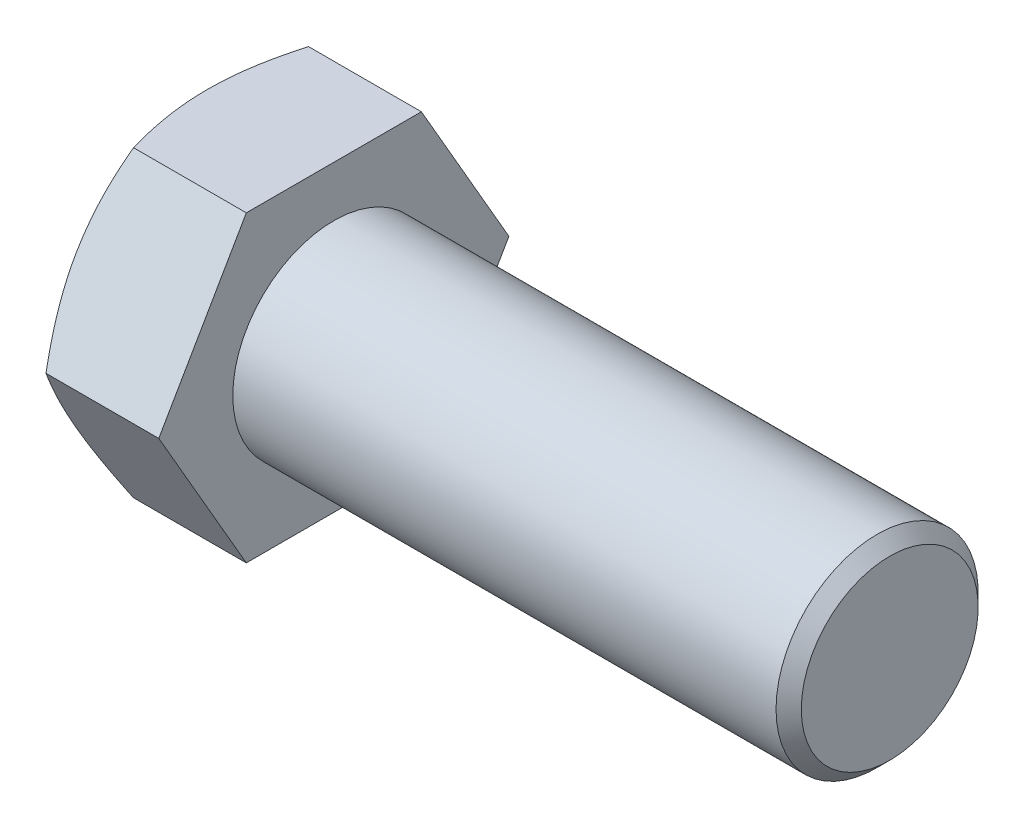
ISO-10303-21;
HEADER;
FILE_DESCRIPTION(('STEP AP214'),'2;1');
FILE_NAME('part.step','',(''),(''),'','','');
FILE_SCHEMA(('AUTOMOTIVE_DESIGN { 1 0 10303 214 1 1 1 1 }'));
ENDSEC;
DATA;
#1=APPLICATION_CONTEXT('core data for automotive mechanical design processes');
#2=APPLICATION_PROTOCOL_DEFINITION('international standard','automotive_design',2000,#1);
#3=PRODUCT_CONTEXT('',#1,'mechanical');
#4=PRODUCT('Part','Part','',(#3));
#5=PRODUCT_RELATED_PRODUCT_CATEGORY('part','',(#4));
#6=PRODUCT_DEFINITION_FORMATION('','',#4);
#7=PRODUCT_DEFINITION_CONTEXT('part definition',#1,'design');
#8=PRODUCT_DEFINITION('design','',#6,#7);
#9=PRODUCT_DEFINITION_SHAPE('','',#8);
#10=(LENGTH_UNIT() NAMED_UNIT(*) SI_UNIT(.MILLI.,.METRE.));
#11=(NAMED_UNIT(*) PLANE_ANGLE_UNIT() SI_UNIT($,.RADIAN.));
#12=(NAMED_UNIT(*) SI_UNIT($,.STERADIAN.) SOLID_ANGLE_UNIT());
#13=UNCERTAINTY_MEASURE_WITH_UNIT(LENGTH_MEASURE(1.E-05),#10,'distance_accuracy_value','');
#14=(GEOMETRIC_REPRESENTATION_CONTEXT(3) GLOBAL_UNCERTAINTY_ASSIGNED_CONTEXT((#13)) GLOBAL_UNIT_ASSIGNED_CONTEXT((#10,
#11,#12)) REPRESENTATION_CONTEXT('',''));
#15=CARTESIAN_POINT('',(0.,0.,0.));
#16=DIRECTION('',(0.,0.,1.));
#17=DIRECTION('',(1.,0.,0.));
#18=AXIS2_PLACEMENT_3D('',#15,#16,#17);
#19=CARTESIAN_POINT('',(0.,8.00000000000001,0.));
#20=DIRECTION('',(-1.,0.,0.));
#21=DIRECTION('',(0.,0.,1.));
#22=AXIS2_PLACEMENT_3D('',#19,#20,#21);
#23=PLANE('',#22);
#24=CARTESIAN_POINT('',(0.,0.,0.));
#25=DIRECTION('',(-1.,0.,0.));
#26=DIRECTION('',(0.,0.,1.));
#27=AXIS2_PLACEMENT_3D('',#24,#25,#26);
#28=CIRCLE('',#27,8.);
#29=CARTESIAN_POINT('',(0.,0.,8.));
#30=VERTEX_POINT('',#29);
#31=EDGE_CURVE('E133',#30,#30,#28,.T.);
#32=ORIENTED_EDGE('',*,*,#31,.T.);
#33=EDGE_LOOP('',(#32));
#34=FACE_BOUND('',#33,.T.);
#35=DIRECTION('',(0.,0.866025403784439,0.500000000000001));
#36=VECTOR('',#35,1.);
#37=CARTESIAN_POINT('',(0.,0.,13.856406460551));
#38=LINE('',#37,#36);
#39=CARTESIAN_POINT('',(0.,-12.,6.9282032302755));
#40=VERTEX_POINT('',#39);
#41=CARTESIAN_POINT('',(0.,0.,13.856406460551));
#42=VERTEX_POINT('',#41);
#43=EDGE_CURVE('E127',#40,#42,#38,.T.);
#44=ORIENTED_EDGE('',*,*,#43,.F.);
#45=DIRECTION('',(0.,0.,1.));
#46=VECTOR('',#45,1.);
#47=CARTESIAN_POINT('',(0.,-12.,0.));
#48=LINE('',#47,#46);
#49=CARTESIAN_POINT('',(0.,-12.,-6.92820323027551));
#50=VERTEX_POINT('',#49);
#51=EDGE_CURVE('E125',#50,#40,#48,.T.);
#52=ORIENTED_EDGE('',*,*,#51,.F.);
#53=DIRECTION('',(0.,-0.866025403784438,0.499999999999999));
#54=VECTOR('',#53,1.);
#55=CARTESIAN_POINT('',(0.,0.,-13.856406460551));
#56=LINE('',#55,#54);
#57=CARTESIAN_POINT('',(0.,0.,-13.856406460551));
#58=VERTEX_POINT('',#57);
#59=EDGE_CURVE('E120',#58,#50,#56,.T.);
#60=ORIENTED_EDGE('',*,*,#59,.F.);
#61=DIRECTION('',(0.,-0.866025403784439,-0.500000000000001));
#62=VECTOR('',#61,1.);
#63=CARTESIAN_POINT('',(0.,12.,-6.92820323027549));
#64=LINE('',#63,#62);
#65=CARTESIAN_POINT('',(0.,12.,-6.92820323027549));
#66=VERTEX_POINT('',#65);
#67=EDGE_CURVE('E118',#66,#58,#64,.T.);
#68=ORIENTED_EDGE('',*,*,#67,.F.);
#69=DIRECTION('',(0.,0.,-1.));
#70=VECTOR('',#69,1.);
#71=CARTESIAN_POINT('',(0.,12.,0.));
#72=LINE('',#71,#70);
#73=CARTESIAN_POINT('',(0.,12.,6.92820323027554));
#74=VERTEX_POINT('',#73);
#75=EDGE_CURVE('E105',#74,#66,#72,.T.);
#76=ORIENTED_EDGE('',*,*,#75,.F.);
#77=DIRECTION('',(0.,0.866025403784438,-0.499999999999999));
#78=VECTOR('',#77,1.);
#79=CARTESIAN_POINT('',(0.,12.,6.92820323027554));
#80=LINE('',#79,#78);
#81=EDGE_CURVE('E98',#42,#74,#80,.T.);
#82=ORIENTED_EDGE('',*,*,#81,.F.);
#83=EDGE_LOOP('',(#44,#52,#60,#68,#76,#82));
#84=FACE_BOUND('',#83,.T.);
#85=ADVANCED_FACE('F26',(#34,#84),#23,.F.);
#86=CARTESIAN_POINT('',(-30.,0.,0.));
#87=DIRECTION('',(-1.,0.,0.));
#88=DIRECTION('',(0.,0.,1.));
#89=AXIS2_PLACEMENT_3D('',#86,#87,#88);
#90=CYLINDRICAL_SURFACE('',#89,8.);
#91=CARTESIAN_POINT('',(43.,0.,0.));
#92=DIRECTION('',(-1.,0.,0.));
#93=DIRECTION('',(0.,0.,1.));
#94=AXIS2_PLACEMENT_3D('',#91,#92,#93);
#95=CIRCLE('',#94,8.);
#96=CARTESIAN_POINT('',(43.,0.,7.99999999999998));
#97=VERTEX_POINT('',#96);
#98=EDGE_CURVE('E137',#97,#97,#95,.T.);
#99=ORIENTED_EDGE('',*,*,#98,.T.);
#100=EDGE_LOOP('',(#99));
#101=FACE_BOUND('',#100,.T.);
#102=ORIENTED_EDGE('',*,*,#31,.F.);
#103=EDGE_LOOP('',(#102));
#104=FACE_BOUND('',#103,.T.);
#105=ADVANCED_FACE('F175',(#101,#104),#90,.T.);
#106=CARTESIAN_POINT('',(44.,8.00000000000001,0.));
#107=DIRECTION('',(-1.,0.,0.));
#108=DIRECTION('',(0.,0.,1.));
#109=AXIS2_PLACEMENT_3D('',#106,#107,#108);
#110=PLANE('',#109);
#111=CARTESIAN_POINT('',(44.,0.,0.));
#112=DIRECTION('',(-1.,0.,0.));
#113=DIRECTION('',(0.,0.,1.));
#114=AXIS2_PLACEMENT_3D('',#111,#112,#113);
#115=CIRCLE('',#114,6.99999999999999);
#116=CARTESIAN_POINT('',(44.,0.,6.99999999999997));
#117=VERTEX_POINT('',#116);
#118=EDGE_CURVE('E140',#117,#117,#115,.F.);
#119=ORIENTED_EDGE('',*,*,#118,.T.);
#120=EDGE_LOOP('',(#119));
#121=FACE_BOUND('',#120,.T.);
#122=ADVANCED_FACE('F170',(#121),#110,.F.);
#123=CARTESIAN_POINT('',(43.,0.,0.));
#124=DIRECTION('',(-1.,0.,0.));
#125=DIRECTION('',(0.,0.,1.));
#126=AXIS2_PLACEMENT_3D('',#123,#124,#125);
#127=CONICAL_SURFACE('',#126,8.,0.785398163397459);
#128=ORIENTED_EDGE('',*,*,#118,.F.);
#129=EDGE_LOOP('',(#128));
#130=FACE_BOUND('',#129,.T.);
#131=ORIENTED_EDGE('',*,*,#98,.F.);
#132=EDGE_LOOP('',(#131));
#133=FACE_BOUND('',#132,.T.);
#134=ADVANCED_FACE('F167',(#130,#133),#127,.T.);
#135=CARTESIAN_POINT('',(44.,-12.,6.92820323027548));
#136=DIRECTION('',(0.,-0.499999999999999,0.866025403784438));
#137=DIRECTION('',(0.,-0.866025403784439,-0.500000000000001));
#138=AXIS2_PLACEMENT_3D('',#135,#136,#137);
#139=PLANE('',#138);
#140=ORIENTED_EDGE('',*,*,#43,.T.);
#141=DIRECTION('',(-1.,0.,0.));
#142=VECTOR('',#141,1.);
#143=CARTESIAN_POINT('',(44.,0.,13.856406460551));
#144=LINE('',#143,#142);
#145=CARTESIAN_POINT('',(-8.9282032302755,0.,13.856406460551));
#146=VERTEX_POINT('',#145);
#147=EDGE_CURVE('E45',#42,#146,#144,.T.);
#148=ORIENTED_EDGE('',*,*,#147,.T.);
#149=CARTESIAN_POINT('',(-8.92813656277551,0.000200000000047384,13.8565219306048));
#150=CARTESIAN_POINT('',(-9.01605036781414,-0.263585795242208,13.7042251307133));
#151=CARTESIAN_POINT('',(-9.09997400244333,-0.528355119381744,13.5513604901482));
#152=CARTESIAN_POINT('',(-9.25873378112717,-1.06001701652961,13.244405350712));
#153=CARTESIAN_POINT('',(-9.33356693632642,-1.32691025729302,13.0903144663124));
#154=CARTESIAN_POINT('',(-9.54298246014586,-2.13189040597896,12.6255589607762));
#155=CARTESIAN_POINT('',(-9.66209676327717,-2.67315507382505,12.3130596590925));
#156=CARTESIAN_POINT('',(-9.80176893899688,-3.48313282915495,11.8454187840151));
#157=CARTESIAN_POINT('',(-9.84155620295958,-3.74942610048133,11.6916742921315));
#158=CARTESIAN_POINT('',(-9.90827663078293,-4.2832455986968,11.3834734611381));
#159=CARTESIAN_POINT('',(-9.93520954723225,-4.55077184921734,11.2290171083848));
#160=CARTESIAN_POINT('',(-9.9755314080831,-5.08627036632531,10.9198468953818));
#161=CARTESIAN_POINT('',(-9.98893644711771,-5.35424172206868,10.7651335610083));
#162=CARTESIAN_POINT('',(-10.0019169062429,-5.890432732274,10.4555635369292));
#163=CARTESIAN_POINT('',(-10.0014927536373,-6.15865237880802,10.3007068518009));
#164=CARTESIAN_POINT('',(-9.98777998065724,-6.66008937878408,10.011202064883));
#165=CARTESIAN_POINT('',(-9.97616401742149,-6.89334249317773,9.87653331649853));
#166=CARTESIAN_POINT('',(-9.94269199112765,-7.35931224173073,9.60750555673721));
#167=CARTESIAN_POINT('',(-9.92083520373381,-7.59202883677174,9.4731465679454));
#168=CARTESIAN_POINT('',(-9.86726258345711,-8.05679907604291,9.20481134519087));
#169=CARTESIAN_POINT('',(-9.8355386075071,-8.28885201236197,9.07083551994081));
#170=CARTESIAN_POINT('',(-9.76278822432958,-8.75186996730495,8.80351197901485));
#171=CARTESIAN_POINT('',(-9.72176118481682,-8.98283491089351,8.67016430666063));
#172=CARTESIAN_POINT('',(-9.58368834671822,-9.68394195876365,8.26537996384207));
#173=CARTESIAN_POINT('',(-9.47287511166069,-10.1520537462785,7.99511549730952));
#174=CARTESIAN_POINT('',(-9.22137423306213,-11.0812971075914,7.45861659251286));
#175=CARTESIAN_POINT('',(-9.08074565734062,-11.5424405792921,7.19237528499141));
#176=CARTESIAN_POINT('',(-8.92813656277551,-12.0002,6.92808776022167));
#177=B_SPLINE_CURVE_WITH_KNOTS('',3,(#149,#150,#151,#152,#153,#154,#155,#156,#157,#158,#159,
#160,#161,#162,#163,#164,#165,#166,#167,#168,#169,#170,#171,#172,#173,#174,#175,#176),
.UNSPECIFIED.,.F.,.F.,(4,2,2,2,2,2,2,2,2,2,2,2,2,4),(0.,0.95100487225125,1.90232158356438,
3.8090046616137,4.73894551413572,5.66890426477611,6.59775529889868,7.52657763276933,
8.33514643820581,9.14377244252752,9.95306755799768,10.7624176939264,12.4167102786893,
14.0677556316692),.UNSPECIFIED.);
#178=CARTESIAN_POINT('',(-10.,-5.99999999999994,10.3923048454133));
#179=VERTEX_POINT('',#178);
#180=EDGE_CURVE('E11',#146,#179,#177,.T.);
#181=ORIENTED_EDGE('',*,*,#180,.T.);
#182=CARTESIAN_POINT('',(-8.9282032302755,-12.,6.92820323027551));
#183=VERTEX_POINT('',#182);
#184=EDGE_CURVE('E29',#179,#183,#177,.T.);
#185=ORIENTED_EDGE('',*,*,#184,.T.);
#186=DIRECTION('',(-1.,0.,0.));
#187=VECTOR('',#186,1.);
#188=CARTESIAN_POINT('',(44.,-12.,6.92820323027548));
#189=LINE('',#188,#187);
#190=EDGE_CURVE('E106',#40,#183,#189,.T.);
#191=ORIENTED_EDGE('',*,*,#190,.F.);
#192=EDGE_LOOP('',(#140,#148,#181,#185,#191));
#193=FACE_BOUND('',#192,.T.);
#194=ADVANCED_FACE('F163',(#193),#139,.T.);
#195=CARTESIAN_POINT('',(44.,-12.,-6.92820323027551));
#196=DIRECTION('',(0.,-1.,0.));
#197=DIRECTION('',(0.,0.,-1.));
#198=AXIS2_PLACEMENT_3D('',#195,#196,#197);
#199=PLANE('',#198);
#200=ORIENTED_EDGE('',*,*,#51,.T.);
#201=ORIENTED_EDGE('',*,*,#190,.T.);
#202=CARTESIAN_POINT('',(-4.25766380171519,-12.,-18.3746485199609));
#203=CARTESIAN_POINT('',(-4.3849992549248,-12.,-18.111224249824));
#204=CARTESIAN_POINT('',(-4.51167569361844,-12.,-17.8474815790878));
#205=CARTESIAN_POINT('',(-4.76355927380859,-12.,-17.3192921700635));
#206=CARTESIAN_POINT('',(-4.88876639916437,-12.,-17.0548454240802));
#207=CARTESIAN_POINT('',(-5.26199318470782,-12.,-16.2602707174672));
#208=CARTESIAN_POINT('',(-5.50757673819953,-12.,-15.7289939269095));
#209=CARTESIAN_POINT('',(-5.99206733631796,-12.,-14.6597289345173));
#210=CARTESIAN_POINT('',(-6.23092813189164,-12.,-14.1217197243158));
#211=CARTESIAN_POINT('',(-6.69839420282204,-12.,-13.0412799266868));
#212=CARTESIAN_POINT('',(-6.92700001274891,-12.,-12.4988495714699));
#213=CARTESIAN_POINT('',(-7.37393662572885,-12.,-11.4019710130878));
#214=CARTESIAN_POINT('',(-7.59210682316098,-12.,-10.8474570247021));
#215=CARTESIAN_POINT('',(-8.01136102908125,-12.,-9.73188464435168));
#216=CARTESIAN_POINT('',(-8.21244313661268,-12.,-9.1708255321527));
#217=CARTESIAN_POINT('',(-8.59211544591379,-12.,-8.04244112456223));
#218=CARTESIAN_POINT('',(-8.77075346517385,-12.,-7.47513205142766));
#219=CARTESIAN_POINT('',(-9.09974481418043,-12.,-6.33239420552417));
#220=CARTESIAN_POINT('',(-9.2501070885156,-12.,-5.75696806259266));
#221=CARTESIAN_POINT('',(-9.44893940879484,-12.,-4.88763161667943));
#222=CARTESIAN_POINT('',(-9.51077517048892,-12.,-4.59675824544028));
#223=CARTESIAN_POINT('',(-9.62456662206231,-12.,-4.01307536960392));
#224=CARTESIAN_POINT('',(-9.67652252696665,-12.,-3.72026590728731));
#225=CARTESIAN_POINT('',(-9.76963405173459,-12.,-3.13290161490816));
#226=CARTESIAN_POINT('',(-9.81078878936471,-12.,-2.83834664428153));
#227=CARTESIAN_POINT('',(-9.88146850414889,-12.,-2.24784691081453));
#228=CARTESIAN_POINT('',(-9.91099394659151,-12.,-1.95190220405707));
#229=CARTESIAN_POINT('',(-9.95762310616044,-12.,-1.36091550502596));
#230=CARTESIAN_POINT('',(-9.97480431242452,-12.,-1.0658796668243));
#231=CARTESIAN_POINT('',(-9.99665375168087,-12.,-0.475345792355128));
#232=CARTESIAN_POINT('',(-10.0013221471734,-12.,-0.179847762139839));
#233=CARTESIAN_POINT('',(-9.9980352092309,-12.,0.410996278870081));
#234=CARTESIAN_POINT('',(-9.9900834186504,-12.,0.706342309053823));
#235=CARTESIAN_POINT('',(-9.96175372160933,-12.,1.29644174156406));
#236=CARTESIAN_POINT('',(-9.94137519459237,-12.,1.59119511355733));
#237=CARTESIAN_POINT('',(-9.87734954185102,-12.,2.30558551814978));
#238=CARTESIAN_POINT('',(-9.82747624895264,-12.,2.72467368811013));
#239=CARTESIAN_POINT('',(-9.70537641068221,-12.0000000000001,3.5596385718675));
#240=CARTESIAN_POINT('',(-9.63314376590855,-12.,3.97551437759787));
#241=CARTESIAN_POINT('',(-9.46888699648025,-12.,4.80371150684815));
#242=CARTESIAN_POINT('',(-9.37684415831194,-12.,5.21602908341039));
#243=CARTESIAN_POINT('',(-9.17577566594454,-12.,6.03642203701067));
#244=CARTESIAN_POINT('',(-9.06675161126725,-12.,6.44449780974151));
#245=CARTESIAN_POINT('',(-8.83147784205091,-12.,7.26645827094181));
#246=CARTESIAN_POINT('',(-8.70487139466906,-12.,7.68024015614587));
#247=CARTESIAN_POINT('',(-8.43915281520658,-12.,8.50342943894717));
#248=CARTESIAN_POINT('',(-8.30004930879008,-12.,8.91283963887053));
#249=CARTESIAN_POINT('',(-8.01219227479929,-12.,9.72564653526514));
#250=CARTESIAN_POINT('',(-7.86349747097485,-12.,10.1290641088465));
#251=CARTESIAN_POINT('',(-7.63396262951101,-12.,10.7317985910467));
#252=CARTESIAN_POINT('',(-7.55635150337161,-12.0000000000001,10.9323543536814));
#253=CARTESIAN_POINT('',(-7.39915540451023,-12.,11.3326857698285));
#254=CARTESIAN_POINT('',(-7.31957047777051,-12.,11.532461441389));
#255=CARTESIAN_POINT('',(-7.23908745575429,-12.,11.7318751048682));
#256=B_SPLINE_CURVE_WITH_KNOTS('',3,(#202,#203,#204,#205,#206,#207,#208,#209,#210,#211,#212,
#213,#214,#215,#216,#217,#218,#219,#220,#221,#222,#223,#224,#225,#226,#227,#228,#229,#230,#231,
#232,#233,#234,#235,#236,#237,#238,#239,#240,#241,#242,#243,#244,#245,#246,#247,#248,#249,#250,
#251,#252,#253,#254,#255),.UNSPECIFIED.,.F.,.F.,(4,2,2,2,2,2,2,2,2,2,2,2,2,2,2,2,2,2,2,2,2,2,2,
2,2,2,4),(0.,0.877756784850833,1.75552320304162,3.51134153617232,5.27720765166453,
7.04298160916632,8.83043428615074,10.6180855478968,12.401861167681,14.1850715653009,
15.077051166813,15.9690113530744,16.861044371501,17.7530416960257,18.6393895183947,
19.5257258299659,20.4118133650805,21.2979451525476,22.5633758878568,23.8291521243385,
25.0961293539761,26.3629873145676,27.6608988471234,28.9579213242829,30.2476433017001,
30.8927821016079,31.5379058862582),.UNSPECIFIED.);
#257=CARTESIAN_POINT('',(-9.99999999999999,-12.,0.));
#258=VERTEX_POINT('',#257);
#259=EDGE_CURVE('E223',#183,#258,#256,.F.);
#260=ORIENTED_EDGE('',*,*,#259,.T.);
#261=CARTESIAN_POINT('',(-8.9282032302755,-12.,-6.92820323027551));
#262=VERTEX_POINT('',#261);
#263=EDGE_CURVE('E243',#258,#262,#256,.F.);
#264=ORIENTED_EDGE('',*,*,#263,.T.);
#265=DIRECTION('',(-1.,0.,0.));
#266=VECTOR('',#265,1.);
#267=CARTESIAN_POINT('',(44.,-12.,-6.92820323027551));
#268=LINE('',#267,#266);
#269=EDGE_CURVE('E232',#50,#262,#268,.T.);
#270=ORIENTED_EDGE('',*,*,#269,.F.);
#271=EDGE_LOOP('',(#200,#201,#260,#264,#270));
#272=FACE_BOUND('',#271,.T.);
#273=ADVANCED_FACE('F166',(#272),#199,.T.);
#274=CARTESIAN_POINT('',(44.,0.,-13.856406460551));
#275=DIRECTION('',(0.,-0.500000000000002,-0.866025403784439));
#276=DIRECTION('',(0.,0.866025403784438,-0.499999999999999));
#277=AXIS2_PLACEMENT_3D('',#274,#275,#276);
#278=PLANE('',#277);
#279=ORIENTED_EDGE('',*,*,#59,.T.);
#280=ORIENTED_EDGE('',*,*,#269,.T.);
#281=CARTESIAN_POINT('',(-8.92813656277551,-12.0002,-6.92808776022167));
#282=CARTESIAN_POINT('',(-9.01605036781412,-11.7364142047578,-7.08038456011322));
#283=CARTESIAN_POINT('',(-9.0999740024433,-11.4716448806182,-7.23324920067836));
#284=CARTESIAN_POINT('',(-9.25873378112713,-10.9399829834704,-7.54020434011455));
#285=CARTESIAN_POINT('',(-9.33356693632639,-10.673089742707,-7.69429522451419));
#286=CARTESIAN_POINT('',(-9.54298246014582,-9.86810959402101,-8.15905073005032));
#287=CARTESIAN_POINT('',(-9.66209676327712,-9.32684492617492,-8.4715500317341));
#288=CARTESIAN_POINT('',(-9.80176893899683,-8.51686717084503,-8.93919090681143));
#289=CARTESIAN_POINT('',(-9.84155620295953,-8.25057389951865,-9.0929353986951));
#290=CARTESIAN_POINT('',(-9.90827663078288,-7.71675440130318,-9.40113622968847));
#291=CARTESIAN_POINT('',(-9.9352095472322,-7.44922815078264,-9.55559258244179));
#292=CARTESIAN_POINT('',(-9.97553140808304,-6.91372963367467,-9.86476279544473));
#293=CARTESIAN_POINT('',(-9.98893644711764,-6.6457582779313,-10.0194761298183));
#294=CARTESIAN_POINT('',(-10.0019169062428,-6.10956726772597,-10.3290461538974));
#295=CARTESIAN_POINT('',(-10.0014927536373,-5.84134762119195,-10.4839028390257));
#296=CARTESIAN_POINT('',(-9.98777998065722,-5.33991062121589,-10.7734076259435));
#297=CARTESIAN_POINT('',(-9.97616401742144,-5.10665750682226,-10.908076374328));
#298=CARTESIAN_POINT('',(-9.94269199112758,-4.64068775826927,-11.1771041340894));
#299=CARTESIAN_POINT('',(-9.92083520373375,-4.40797116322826,-11.3114631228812));
#300=CARTESIAN_POINT('',(-9.86726258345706,-3.94320092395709,-11.5797983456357));
#301=CARTESIAN_POINT('',(-9.83553860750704,-3.71114798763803,-11.7137741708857));
#302=CARTESIAN_POINT('',(-9.76278822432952,-3.24813003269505,-11.9810977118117));
#303=CARTESIAN_POINT('',(-9.72176118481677,-3.01716508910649,-12.1144453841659));
#304=CARTESIAN_POINT('',(-9.58368834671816,-2.31605804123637,-12.5192297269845));
#305=CARTESIAN_POINT('',(-9.47287511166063,-1.84794625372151,-12.789494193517));
#306=CARTESIAN_POINT('',(-9.22137423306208,-0.918702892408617,-13.3259930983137));
#307=CARTESIAN_POINT('',(-9.08074565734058,-0.457559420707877,-13.5922344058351));
#308=CARTESIAN_POINT('',(-8.92813656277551,0.000199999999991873,-13.8565219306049));
#309=B_SPLINE_CURVE_WITH_KNOTS('',3,(#281,#282,#283,#284,#285,#286,#287,#288,#289,#290,#291,
#292,#293,#294,#295,#296,#297,#298,#299,#300,#301,#302,#303,#304,#305,#306,#307,#308),
.UNSPECIFIED.,.F.,.F.,(4,2,2,2,2,2,2,2,2,2,2,2,2,4),(0.,0.951004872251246,1.90232158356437,
3.80900466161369,4.73894551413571,5.6689042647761,6.59775529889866,7.52657763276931,
8.33514643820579,9.14377244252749,9.95306755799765,10.7624176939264,12.4167102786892,
14.0677556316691),.UNSPECIFIED.);
#310=CARTESIAN_POINT('',(-9.99999999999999,-6.00000000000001,-10.3923048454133));
#311=VERTEX_POINT('',#310);
#312=EDGE_CURVE('E245',#262,#311,#309,.T.);
#313=ORIENTED_EDGE('',*,*,#312,.T.);
#314=CARTESIAN_POINT('',(-8.9282032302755,0.,-13.856406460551));
#315=VERTEX_POINT('',#314);
#316=EDGE_CURVE('E246',#311,#315,#309,.T.);
#317=ORIENTED_EDGE('',*,*,#316,.T.);
#318=DIRECTION('',(-1.,0.,0.));
#319=VECTOR('',#318,1.);
#320=CARTESIAN_POINT('',(44.,0.,-13.856406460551));
#321=LINE('',#320,#319);
#322=EDGE_CURVE('E229',#58,#315,#321,.T.);
#323=ORIENTED_EDGE('',*,*,#322,.F.);
#324=EDGE_LOOP('',(#279,#280,#313,#317,#323));
#325=FACE_BOUND('',#324,.T.);
#326=ADVANCED_FACE('F241',(#325),#278,.T.);
#327=CARTESIAN_POINT('',(44.,12.,-6.92820323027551));
#328=DIRECTION('',(0.,0.499999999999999,-0.866025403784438));
#329=DIRECTION('',(0.,0.866025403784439,0.500000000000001));
#330=AXIS2_PLACEMENT_3D('',#327,#328,#329);
#331=PLANE('',#330);
#332=ORIENTED_EDGE('',*,*,#67,.T.);
#333=ORIENTED_EDGE('',*,*,#322,.T.);
#334=CARTESIAN_POINT('',(-8.92813656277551,-0.000200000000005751,-13.8565219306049));
#335=CARTESIAN_POINT('',(-9.01605036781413,0.263585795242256,-13.7042251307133));
#336=CARTESIAN_POINT('',(-9.09997400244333,0.528355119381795,-13.5513604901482));
#337=CARTESIAN_POINT('',(-9.25873378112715,1.06001701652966,-13.244405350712));
#338=CARTESIAN_POINT('',(-9.33356693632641,1.32691025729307,-13.0903144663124));
#339=CARTESIAN_POINT('',(-9.54298246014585,2.13189040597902,-12.6255589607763));
#340=CARTESIAN_POINT('',(-9.66209676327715,2.67315507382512,-12.3130596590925));
#341=CARTESIAN_POINT('',(-9.80176893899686,3.48313282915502,-11.8454187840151));
#342=CARTESIAN_POINT('',(-9.84155620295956,3.7494261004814,-11.6916742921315));
#343=CARTESIAN_POINT('',(-9.90827663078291,4.28324559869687,-11.3834734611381));
#344=CARTESIAN_POINT('',(-9.93520954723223,4.55077184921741,-11.2290171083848));
#345=CARTESIAN_POINT('',(-9.97553140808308,5.08627036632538,-10.9198468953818));
#346=CARTESIAN_POINT('',(-9.98893644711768,5.35424172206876,-10.7651335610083));
#347=CARTESIAN_POINT('',(-10.0019169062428,5.89043273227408,-10.4555635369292));
#348=CARTESIAN_POINT('',(-10.0014927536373,6.15865237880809,-10.3007068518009));
#349=CARTESIAN_POINT('',(-9.98777998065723,6.66008937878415,-10.011202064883));
#350=CARTESIAN_POINT('',(-9.97616401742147,6.8933424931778,-9.87653331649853));
#351=CARTESIAN_POINT('',(-9.94269199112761,7.35931224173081,-9.60750555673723));
#352=CARTESIAN_POINT('',(-9.92083520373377,7.59202883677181,-9.47314656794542));
#353=CARTESIAN_POINT('',(-9.86726258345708,8.05679907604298,-9.20481134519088));
#354=CARTESIAN_POINT('',(-9.83553860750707,8.28885201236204,-9.07083551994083));
#355=CARTESIAN_POINT('',(-9.76278822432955,8.75186996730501,-8.80351197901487));
#356=CARTESIAN_POINT('',(-9.72176118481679,8.98283491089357,-8.67016430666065));
#357=CARTESIAN_POINT('',(-9.58368834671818,9.6839419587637,-8.26537996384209));
#358=CARTESIAN_POINT('',(-9.47287511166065,10.1520537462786,-7.99511549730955));
#359=CARTESIAN_POINT('',(-9.22137423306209,11.0812971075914,-7.45861659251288));
#360=CARTESIAN_POINT('',(-9.0807456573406,11.5424405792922,-7.19237528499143));
#361=CARTESIAN_POINT('',(-8.92813656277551,12.0002,-6.92808776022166));
#362=B_SPLINE_CURVE_WITH_KNOTS('',3,(#334,#335,#336,#337,#338,#339,#340,#341,#342,#343,#344,
#345,#346,#347,#348,#349,#350,#351,#352,#353,#354,#355,#356,#357,#358,#359,#360,#361),
.UNSPECIFIED.,.F.,.F.,(4,2,2,2,2,2,2,2,2,2,2,2,2,4),(0.,0.951004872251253,1.90232158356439,
3.80900466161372,4.73894551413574,5.66890426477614,6.59775529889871,7.52657763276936,
8.33514643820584,9.14377244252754,9.9530675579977,10.7624176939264,12.4167102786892,
14.0677556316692),.UNSPECIFIED.);
#363=CARTESIAN_POINT('',(-10.,6.00000000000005,-10.3923048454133));
#364=VERTEX_POINT('',#363);
#365=EDGE_CURVE('E267',#315,#364,#362,.T.);
#366=ORIENTED_EDGE('',*,*,#365,.T.);
#367=CARTESIAN_POINT('',(-8.9282032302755,12.,-6.9282032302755));
#368=VERTEX_POINT('',#367);
#369=EDGE_CURVE('E212',#364,#368,#362,.T.);
#370=ORIENTED_EDGE('',*,*,#369,.T.);
#371=DIRECTION('',(-1.,0.,0.));
#372=VECTOR('',#371,1.);
#373=CARTESIAN_POINT('',(44.,12.,-6.92820323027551));
#374=LINE('',#373,#372);
#375=EDGE_CURVE('E114',#66,#368,#374,.T.);
#376=ORIENTED_EDGE('',*,*,#375,.F.);
#377=EDGE_LOOP('',(#332,#333,#366,#370,#376));
#378=FACE_BOUND('',#377,.T.);
#379=ADVANCED_FACE('F260',(#378),#331,.T.);
#380=CARTESIAN_POINT('',(44.,12.,6.9282032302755));
#381=DIRECTION('',(0.,1.,0.));
#382=DIRECTION('',(0.,0.,1.));
#383=AXIS2_PLACEMENT_3D('',#380,#381,#382);
#384=PLANE('',#383);
#385=ORIENTED_EDGE('',*,*,#75,.T.);
#386=ORIENTED_EDGE('',*,*,#375,.T.);
#387=CARTESIAN_POINT('',(-4.25766380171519,12.,-18.3746485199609));
#388=CARTESIAN_POINT('',(-4.38499925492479,12.,-18.111224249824));
#389=CARTESIAN_POINT('',(-4.51167569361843,12.,-17.8474815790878));
#390=CARTESIAN_POINT('',(-4.76355927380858,12.,-17.3192921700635));
#391=CARTESIAN_POINT('',(-4.88876639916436,12.,-17.0548454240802));
#392=CARTESIAN_POINT('',(-5.26199318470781,12.,-16.2602707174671));
#393=CARTESIAN_POINT('',(-5.50757673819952,12.,-15.7289939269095));
#394=CARTESIAN_POINT('',(-5.99206733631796,12.,-14.6597289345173));
#395=CARTESIAN_POINT('',(-6.23092813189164,12.,-14.1217197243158));
#396=CARTESIAN_POINT('',(-6.69839420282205,12.,-13.0412799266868));
#397=CARTESIAN_POINT('',(-6.92700001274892,12.,-12.4988495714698));
#398=CARTESIAN_POINT('',(-7.37393662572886,12.,-11.4019710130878));
#399=CARTESIAN_POINT('',(-7.59210682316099,12.,-10.847457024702));
#400=CARTESIAN_POINT('',(-8.01136102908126,12.,-9.73188464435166));
#401=CARTESIAN_POINT('',(-8.21244313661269,12.,-9.17082553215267));
#402=CARTESIAN_POINT('',(-8.59211544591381,12.,-8.0424411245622));
#403=CARTESIAN_POINT('',(-8.77075346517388,12.,-7.47513205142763));
#404=CARTESIAN_POINT('',(-9.09974481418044,12.,-6.33239420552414));
#405=CARTESIAN_POINT('',(-9.25010708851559,12.0000000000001,-5.75696806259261));
#406=CARTESIAN_POINT('',(-9.44893940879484,12.,-4.88763161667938));
#407=CARTESIAN_POINT('',(-9.51077517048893,12.,-4.59675824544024));
#408=CARTESIAN_POINT('',(-9.62456662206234,12.,-4.01307536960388));
#409=CARTESIAN_POINT('',(-9.67652252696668,12.,-3.72026590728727));
#410=CARTESIAN_POINT('',(-9.76963405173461,12.,-3.13290161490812));
#411=CARTESIAN_POINT('',(-9.81078878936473,12.,-2.8383466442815));
#412=CARTESIAN_POINT('',(-9.88146850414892,12.,-2.2478469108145));
#413=CARTESIAN_POINT('',(-9.91099394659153,12.,-1.95190220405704));
#414=CARTESIAN_POINT('',(-9.95762310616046,12.,-1.36091550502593));
#415=CARTESIAN_POINT('',(-9.97480431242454,12.,-1.06587966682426));
#416=CARTESIAN_POINT('',(-9.99665375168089,12.,-0.475345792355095));
#417=CARTESIAN_POINT('',(-10.0013221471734,12.,-0.179847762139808));
#418=CARTESIAN_POINT('',(-9.99803520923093,12.,0.410996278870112));
#419=CARTESIAN_POINT('',(-9.99008341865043,12.,0.706342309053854));
#420=CARTESIAN_POINT('',(-9.96175372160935,12.,1.29644174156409));
#421=CARTESIAN_POINT('',(-9.94137519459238,12.,1.59119511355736));
#422=CARTESIAN_POINT('',(-9.87734954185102,12.0000000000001,2.30558551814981));
#423=CARTESIAN_POINT('',(-9.82747624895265,12.,2.72467368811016));
#424=CARTESIAN_POINT('',(-9.70537641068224,11.9999999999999,3.55963857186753));
#425=CARTESIAN_POINT('',(-9.63314376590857,12.,3.9755143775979));
#426=CARTESIAN_POINT('',(-9.46888699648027,12.,4.80371150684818));
#427=CARTESIAN_POINT('',(-9.37684415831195,12.,5.21602908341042));
#428=CARTESIAN_POINT('',(-9.17577566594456,12.,6.0364220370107));
#429=CARTESIAN_POINT('',(-9.06675161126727,12.,6.44449780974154));
#430=CARTESIAN_POINT('',(-8.83147784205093,12.,7.26645827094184));
#431=CARTESIAN_POINT('',(-8.70487139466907,12.,7.6802401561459));
#432=CARTESIAN_POINT('',(-8.4391528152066,12.,8.5034294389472));
#433=CARTESIAN_POINT('',(-8.3000493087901,12.,8.91283963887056));
#434=CARTESIAN_POINT('',(-8.01219227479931,12.,9.72564653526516));
#435=CARTESIAN_POINT('',(-7.86349747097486,12.,10.1290641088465));
#436=CARTESIAN_POINT('',(-7.63396262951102,12.,10.7317985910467));
#437=CARTESIAN_POINT('',(-7.55635150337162,12.,10.9323543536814));
#438=CARTESIAN_POINT('',(-7.39915540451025,12.,11.3326857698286));
#439=CARTESIAN_POINT('',(-7.31957047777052,12.,11.5324614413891));
#440=CARTESIAN_POINT('',(-7.23908745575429,12.,11.7318751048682));
#441=B_SPLINE_CURVE_WITH_KNOTS('',3,(#387,#388,#389,#390,#391,#392,#393,#394,#395,#396,#397,
#398,#399,#400,#401,#402,#403,#404,#405,#406,#407,#408,#409,#410,#411,#412,#413,#414,#415,#416,
#417,#418,#419,#420,#421,#422,#423,#424,#425,#426,#427,#428,#429,#430,#431,#432,#433,#434,#435,
#436,#437,#438,#439,#440),.UNSPECIFIED.,.F.,.F.,(4,2,2,2,2,2,2,2,2,2,2,2,2,2,2,2,2,2,2,2,2,2,2,
2,2,2,4),(0.,0.877756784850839,1.75552320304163,3.51134153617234,5.27720765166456,
7.04298160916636,8.83043428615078,10.6180855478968,12.4018611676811,14.1850715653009,
15.0770511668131,15.9690113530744,16.861044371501,17.7530416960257,18.6393895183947,
19.5257258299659,20.4118133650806,21.2979451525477,22.5633758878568,23.8291521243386,
25.0961293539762,26.3629873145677,27.6608988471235,28.9579213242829,30.2476433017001,
30.8927821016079,31.5379058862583),.UNSPECIFIED.);
#442=CARTESIAN_POINT('',(-10.,12.,0.));
#443=VERTEX_POINT('',#442);
#444=EDGE_CURVE('E208',#368,#443,#441,.T.);
#445=ORIENTED_EDGE('',*,*,#444,.T.);
#446=CARTESIAN_POINT('',(-8.9282032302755,12.0000000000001,6.92820323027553));
#447=VERTEX_POINT('',#446);
#448=EDGE_CURVE('E113',#443,#447,#441,.T.);
#449=ORIENTED_EDGE('',*,*,#448,.T.);
#450=DIRECTION('',(-1.,0.,0.));
#451=VECTOR('',#450,1.);
#452=CARTESIAN_POINT('',(44.,12.,6.9282032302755));
#453=LINE('',#452,#451);
#454=EDGE_CURVE('E101',#74,#447,#453,.T.);
#455=ORIENTED_EDGE('',*,*,#454,.F.);
#456=EDGE_LOOP('',(#385,#386,#445,#449,#455));
#457=FACE_BOUND('',#456,.T.);
#458=ADVANCED_FACE('F109',(#457),#384,.T.);
#459=CARTESIAN_POINT('',(44.,0.,13.856406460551));
#460=DIRECTION('',(0.,0.500000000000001,0.866025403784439));
#461=DIRECTION('',(0.,-0.866025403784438,0.499999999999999));
#462=AXIS2_PLACEMENT_3D('',#459,#460,#461);
#463=PLANE('',#462);
#464=ORIENTED_EDGE('',*,*,#81,.T.);
#465=ORIENTED_EDGE('',*,*,#454,.T.);
#466=CARTESIAN_POINT('',(-8.92813656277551,12.0002,6.92808776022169));
#467=CARTESIAN_POINT('',(-9.01605036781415,11.7364142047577,7.08038456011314));
#468=CARTESIAN_POINT('',(-9.09997400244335,11.4716448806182,7.23324920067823));
#469=CARTESIAN_POINT('',(-9.25873378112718,10.9399829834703,7.54020434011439));
#470=CARTESIAN_POINT('',(-9.33356693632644,10.6730897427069,7.69429522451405));
#471=CARTESIAN_POINT('',(-9.54298246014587,9.86810959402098,8.15905073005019));
#472=CARTESIAN_POINT('',(-9.66209676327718,9.32684492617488,8.47155003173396));
#473=CARTESIAN_POINT('',(-9.80176893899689,8.51686717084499,8.93919090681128));
#474=CARTESIAN_POINT('',(-9.84155620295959,8.25057389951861,9.09293539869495));
#475=CARTESIAN_POINT('',(-9.90827663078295,7.71675440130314,9.40113622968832));
#476=CARTESIAN_POINT('',(-9.93520954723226,7.4492281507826,9.55559258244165));
#477=CARTESIAN_POINT('',(-9.97553140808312,6.91372963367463,9.86476279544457));
#478=CARTESIAN_POINT('',(-9.98893644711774,6.64575827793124,10.0194761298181));
#479=CARTESIAN_POINT('',(-10.0019169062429,6.10956726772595,10.3290461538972));
#480=CARTESIAN_POINT('',(-10.0014927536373,5.84134762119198,10.4839028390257));
#481=CARTESIAN_POINT('',(-9.98777998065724,5.33991062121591,10.7734076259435));
#482=CARTESIAN_POINT('',(-9.9761640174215,5.10665750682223,10.9080763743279));
#483=CARTESIAN_POINT('',(-9.94269199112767,4.6406877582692,11.1771041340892));
#484=CARTESIAN_POINT('',(-9.92083520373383,4.4079711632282,11.311463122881));
#485=CARTESIAN_POINT('',(-9.86726258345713,3.94320092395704,11.5797983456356));
#486=CARTESIAN_POINT('',(-9.83553860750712,3.71114798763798,11.7137741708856));
#487=CARTESIAN_POINT('',(-9.7627882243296,3.248130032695,11.9810977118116));
#488=CARTESIAN_POINT('',(-9.72176118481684,3.01716508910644,12.1144453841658));
#489=CARTESIAN_POINT('',(-9.58368834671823,2.31605804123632,12.5192297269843));
#490=CARTESIAN_POINT('',(-9.47287511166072,1.84794625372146,12.7894941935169));
#491=CARTESIAN_POINT('',(-9.22137423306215,0.918702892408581,13.3259930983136));
#492=CARTESIAN_POINT('',(-9.08074565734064,0.457559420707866,13.592234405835));
#493=CARTESIAN_POINT('',(-8.92813656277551,-0.000199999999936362,13.8565219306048));
#494=B_SPLINE_CURVE_WITH_KNOTS('',3,(#466,#467,#468,#469,#470,#471,#472,#473,#474,#475,#476,
#477,#478,#479,#480,#481,#482,#483,#484,#485,#486,#487,#488,#489,#490,#491,#492,#493),
.UNSPECIFIED.,.F.,.F.,(4,2,2,2,2,2,2,2,2,2,2,2,2,4),(0.,0.951004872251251,1.90232158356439,
3.8090046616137,4.73894551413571,5.66890426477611,6.59775529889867,7.52657763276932,
8.3351464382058,9.14377244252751,9.95306755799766,10.7624176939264,12.4167102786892,
14.0677556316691),.UNSPECIFIED.);
#495=CARTESIAN_POINT('',(-10.,6.00000000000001,10.3923048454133));
#496=VERTEX_POINT('',#495);
#497=EDGE_CURVE('E51',#447,#496,#494,.T.);
#498=ORIENTED_EDGE('',*,*,#497,.T.);
#499=EDGE_CURVE('E143',#496,#146,#494,.T.);
#500=ORIENTED_EDGE('',*,*,#499,.T.);
#501=ORIENTED_EDGE('',*,*,#147,.F.);
#502=EDGE_LOOP('',(#464,#465,#498,#500,#501));
#503=FACE_BOUND('',#502,.T.);
#504=ADVANCED_FACE('F100',(#503),#463,.T.);
#505=CARTESIAN_POINT('',(-8.927968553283,0.,0.));
#506=DIRECTION('',(1.,0.,0.));
#507=DIRECTION('',(0.,0.,-1.));
#508=AXIS2_PLACEMENT_3D('',#505,#506,#507);
#509=CONICAL_SURFACE('',#508,13.8568129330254,1.04719755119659);
#510=ORIENTED_EDGE('',*,*,#184,.F.);
#511=CARTESIAN_POINT('',(-10.,0.,0.));
#512=DIRECTION('',(-1.,0.,0.));
#513=DIRECTION('',(0.,0.,1.));
#514=AXIS2_PLACEMENT_3D('',#511,#512,#513);
#515=CIRCLE('',#514,12.);
#516=EDGE_CURVE('E217',#258,#179,#515,.T.);
#517=ORIENTED_EDGE('',*,*,#516,.F.);
#518=ORIENTED_EDGE('',*,*,#259,.F.);
#519=EDGE_LOOP('',(#510,#517,#518));
#520=FACE_BOUND('',#519,.T.);
#521=ADVANCED_FACE('F160',(#520),#509,.T.);
#522=ORIENTED_EDGE('',*,*,#263,.F.);
#523=EDGE_CURVE('E215',#311,#258,#515,.T.);
#524=ORIENTED_EDGE('',*,*,#523,.F.);
#525=ORIENTED_EDGE('',*,*,#312,.F.);
#526=EDGE_LOOP('',(#522,#524,#525));
#527=FACE_BOUND('',#526,.T.);
#528=ADVANCED_FACE('F272',(#527),#509,.T.);
#529=ORIENTED_EDGE('',*,*,#316,.F.);
#530=EDGE_CURVE('E214',#364,#311,#515,.T.);
#531=ORIENTED_EDGE('',*,*,#530,.F.);
#532=ORIENTED_EDGE('',*,*,#365,.F.);
#533=EDGE_LOOP('',(#529,#531,#532));
#534=FACE_BOUND('',#533,.T.);
#535=ADVANCED_FACE('F271',(#534),#509,.T.);
#536=ORIENTED_EDGE('',*,*,#369,.F.);
#537=EDGE_CURVE('E134',#443,#364,#515,.T.);
#538=ORIENTED_EDGE('',*,*,#537,.F.);
#539=ORIENTED_EDGE('',*,*,#444,.F.);
#540=EDGE_LOOP('',(#536,#538,#539));
#541=FACE_BOUND('',#540,.T.);
#542=ADVANCED_FACE('F199',(#541),#509,.T.);
#543=ORIENTED_EDGE('',*,*,#448,.F.);
#544=EDGE_CURVE('E130',#496,#443,#515,.T.);
#545=ORIENTED_EDGE('',*,*,#544,.F.);
#546=ORIENTED_EDGE('',*,*,#497,.F.);
#547=EDGE_LOOP('',(#543,#545,#546));
#548=FACE_BOUND('',#547,.T.);
#549=ADVANCED_FACE('F192',(#548),#509,.T.);
#550=CARTESIAN_POINT('',(-10.,12.,0.));
#551=DIRECTION('',(1.,0.,0.));
#552=DIRECTION('',(0.,0.,-1.));
#553=AXIS2_PLACEMENT_3D('',#550,#551,#552);
#554=PLANE('',#553);
#555=ORIENTED_EDGE('',*,*,#544,.T.);
#556=ORIENTED_EDGE('',*,*,#537,.T.);
#557=ORIENTED_EDGE('',*,*,#530,.T.);
#558=ORIENTED_EDGE('',*,*,#523,.T.);
#559=ORIENTED_EDGE('',*,*,#516,.T.);
#560=EDGE_CURVE('E129',#179,#496,#515,.T.);
#561=ORIENTED_EDGE('',*,*,#560,.T.);
#562=EDGE_LOOP('',(#555,#556,#557,#558,#559,#561));
#563=FACE_BOUND('',#562,.T.);
#564=ADVANCED_FACE('F190',(#563),#554,.F.);
#565=ORIENTED_EDGE('',*,*,#180,.F.);
#566=ORIENTED_EDGE('',*,*,#499,.F.);
#567=ORIENTED_EDGE('',*,*,#560,.F.);
#568=EDGE_LOOP('',(#565,#566,#567));
#569=FACE_BOUND('',#568,.T.);
#570=ADVANCED_FACE('F154',(#569),#509,.T.);
#571=CLOSED_SHELL('',(#85,#105,#122,#134,#194,#273,#326,#379,#458,#504,#521,#528,#535,#542,#549,
#564,#570));
#572=MANIFOLD_SOLID_BREP('B2',#571);
#573=ADVANCED_BREP_SHAPE_REPRESENTATION('',(#18,#572),#14);
#574=SHAPE_DEFINITION_REPRESENTATION(#9,#573);
ENDSEC;
END-ISO-10303-21;
